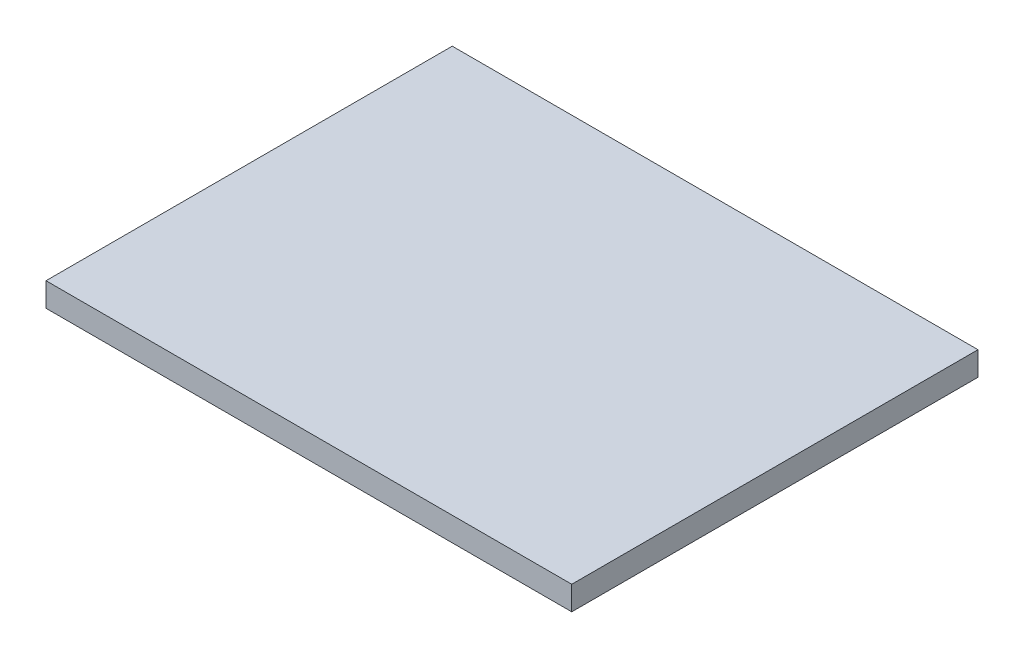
from build123d import *

# Parameters (mm, degrees)
SKETCH1_W      = 110
SKETCH1_H      = 85
EXTRUDE1_DEPTH = 5


with BuildPart() as part:
    # Sketch1 → Extrude1 (new body)
    with BuildSketch(Plane(origin=(0, 0, 0), x_dir=(1, 0, 0), z_dir=(0, 1, 0))):
        with Locations((55, 42.5)):
            Rectangle(SKETCH1_W, SKETCH1_H)
    extrude(amount=EXTRUDE1_DEPTH)


solid = part.part
